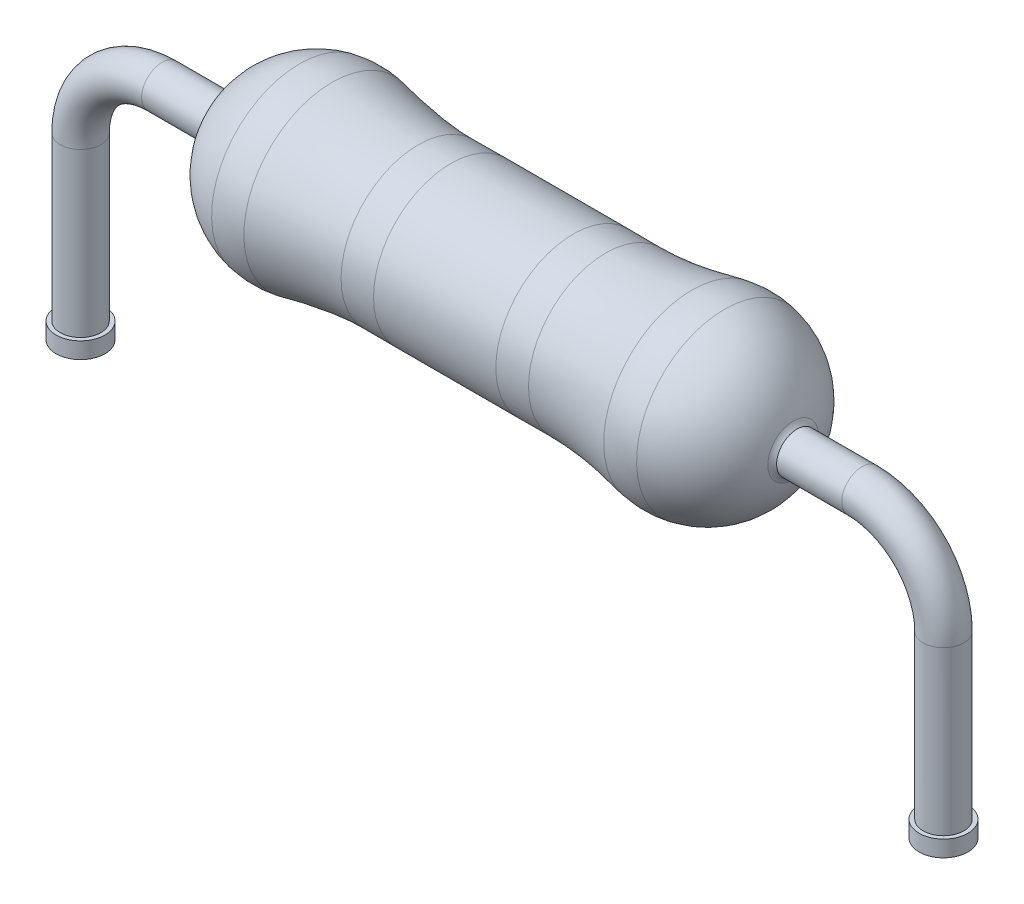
from build123d import *

# Parameters (mm, degrees)
SKETCH3_R           = 0.25
SKETCH14_R          = 0.25
SKETCH16_R          = 0.3
BOSS_EXTRUDE1_DEPTH = 0.2
SKETCH17_R          = 0.3
BOSS_EXTRUDE2_DEPTH = 0.2


with BuildPart() as part:
    # Sketch1 → Revolve1 (revolve)
    with BuildSketch(Plane.XY):
        with BuildLine():
            Line((3.5, 0), (3.5, 0.25))
            add(Edge.make_bspline(
                [(3.5, 0.25), (3.471344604, 0.276701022), (3.454772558, 0.312177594)],
                knots=[0, 0, 0, 1, 1, 1], degree=2))
            ThreePointArc((3.454772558, 0.312177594), (2.97941585, 0.935027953), (2.210086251, 1.08348178))
            add(Edge.make_bspline(
                [(0.751281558, 0.95), (0.922733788, 0.954106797), (1.413540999, 0.927963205), (1.898117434, 1.017502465), (2.210086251, 1.08348178)],
                knots=[0, 0, 0, 0, 0.350784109, 1, 1, 1, 1], degree=3))
            Line((0.751281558, 0.95), (-0.751281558, 0.95))
            add(Edge.make_bspline(
                [(-0.751281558, 0.95), (-0.922733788, 0.954106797), (-1.413540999, 0.927963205), (-1.898117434, 1.017502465), (-2.210086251, 1.08348178)],
                knots=[0, 0, 0, 0, 0.350784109, 1, 1, 1, 1], degree=3))
            ThreePointArc((-2.210086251, 1.08348178), (-2.97941585, 0.935027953), (-3.454772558, 0.312177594))
            add(Edge.make_bspline(
                [(-3.5, 0.25), (-3.471344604, 0.276701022), (-3.454772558, 0.312177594)],
                knots=[0, 0, 0, 1, 1, 1], degree=2))
            Line((-3.5, 0.25), (-3.5, 0))
            Line((-3.5, 0), (3.5, 0))
        make_face()
    revolve(axis=Axis((-6.223683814, 0, 0), (1, 0, 0)))

    # Sweep1: sweep along a path in Sketch5
    with BuildLine(Plane.XY) as sweep1_path:
        Line((-3.5, 0), (-4.3, 0))
        ThreePointArc((-4.3, 0), (-5.007106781, -0.292893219), (-5.3, -1))
        Line((-5.3, -1), (-5.3, -3))
    # Sketch3 → Sweep1 (sweep)
    with BuildSketch(Plane.ZY.offset(3.5)):
        Circle(SKETCH3_R)
    sweep(path=sweep1_path.line)

    # Sweep2: sweep along a path in Sketch15
    with BuildLine(Plane.XY) as sweep2_path:
        Line((3.5, 0), (4.3, 0))
        ThreePointArc((4.3, 0), (5.007106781, -0.292893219), (5.3, -1))
        Line((5.3, -1), (5.3, -3))
    # Sketch14 → Sweep2 (sweep)
    with BuildSketch(Plane(origin=(3.5, 0, 0), x_dir=(0, 0, -1), z_dir=(1, 0, 0))):
        Circle(SKETCH14_R)
    sweep(path=sweep2_path.line)

    # Sketch16 → Boss-Extrude1 (add)
    with BuildSketch(Plane.XZ.offset(3)):
        with Locations((-5.3, 0)):
            Circle(SKETCH16_R)
    extrude(amount=BOSS_EXTRUDE1_DEPTH)

    # Sketch17 → Boss-Extrude2 (add)
    with BuildSketch(Plane.XZ.offset(3)):
        with Locations(Location((5.3, 0, 0), (0, 0, 270))):
            Circle(SKETCH17_R)
    extrude(amount=BOSS_EXTRUDE2_DEPTH)


solid = part.part
